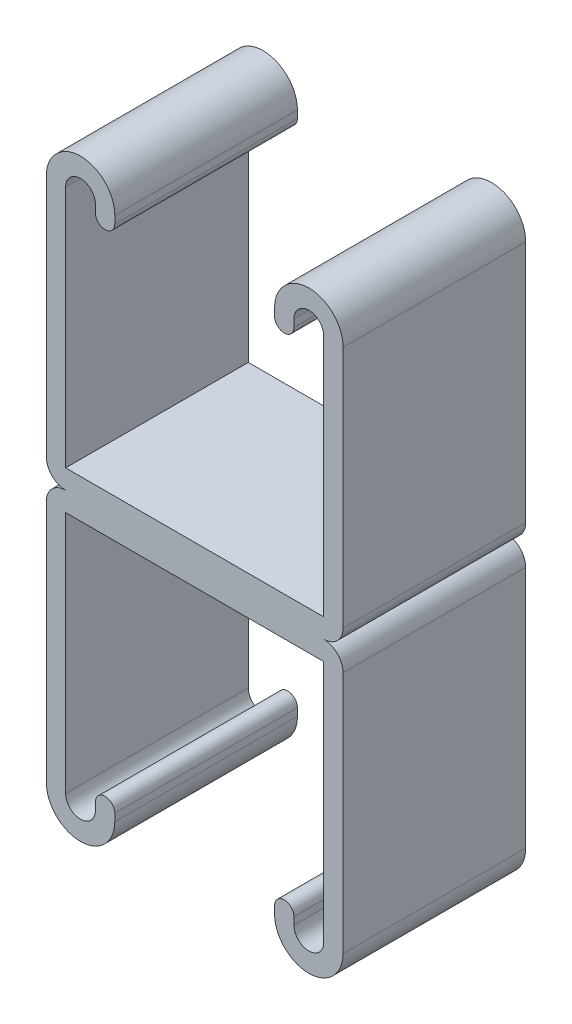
from build123d import *

# Parameters (mm, degrees)
BASE_EXTRUDE_DEPTH = 12.7


with BuildPart() as part:
    # Sketch1 → Base-Extrude (new, symmetric)
    with BuildSketch(Plane.XY):
        with BuildLine():
            Line((-20.6375, 36.5125), (-20.6375, 2.6924))
            ThreePointArc((-20.6375, 2.6924), (-19.848914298, 0.788585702), (-17.9451, 0))
            Line((-17.9451, 0), (17.9451, 0))
            ThreePointArc((17.9451, 0), (19.848914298, 0.788585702), (20.6375, 2.6924))
            Line((20.6375, 2.6924), (20.6375, 36.5125))
            ThreePointArc((20.6375, 36.5125), (15.875, 41.275), (11.1125, 36.5125))
            Line((11.1125, 36.5125), (11.1125, 35.47745))
            ThreePointArc((11.1125, 35.47745), (12.4587, 34.13125), (13.8049, 35.47745))
            Line((13.8049, 35.47745), (13.8049, 36.5125))
            ThreePointArc((13.8049, 36.5125), (15.875, 38.5826), (17.9451, 36.5125))
            Line((17.9451, 36.5125), (17.9451, 2.6924))
            Line((17.9451, 2.6924), (-17.9451, 2.6924))
            Line((-17.9451, 2.6924), (-17.9451, 36.5125))
            ThreePointArc((-17.9451, 36.5125), (-15.875, 38.5826), (-13.8049, 36.5125))
            Line((-13.8049, 36.5125), (-13.8049, 35.47745))
            ThreePointArc((-13.8049, 35.47745), (-12.4587, 34.13125), (-11.1125, 35.47745))
            Line((-11.1125, 35.47745), (-11.1125, 36.5125))
            ThreePointArc((-11.1125, 36.5125), (-15.875, 41.275), (-20.6375, 36.5125))
        make_face()
    base_extrude = extrude(amount=BASE_EXTRUDE_DEPTH, both=True)

    # Mirror1: Base-Extrude across plane
    add(base_extrude.mirror(Plane.ZX))


solid = part.part
